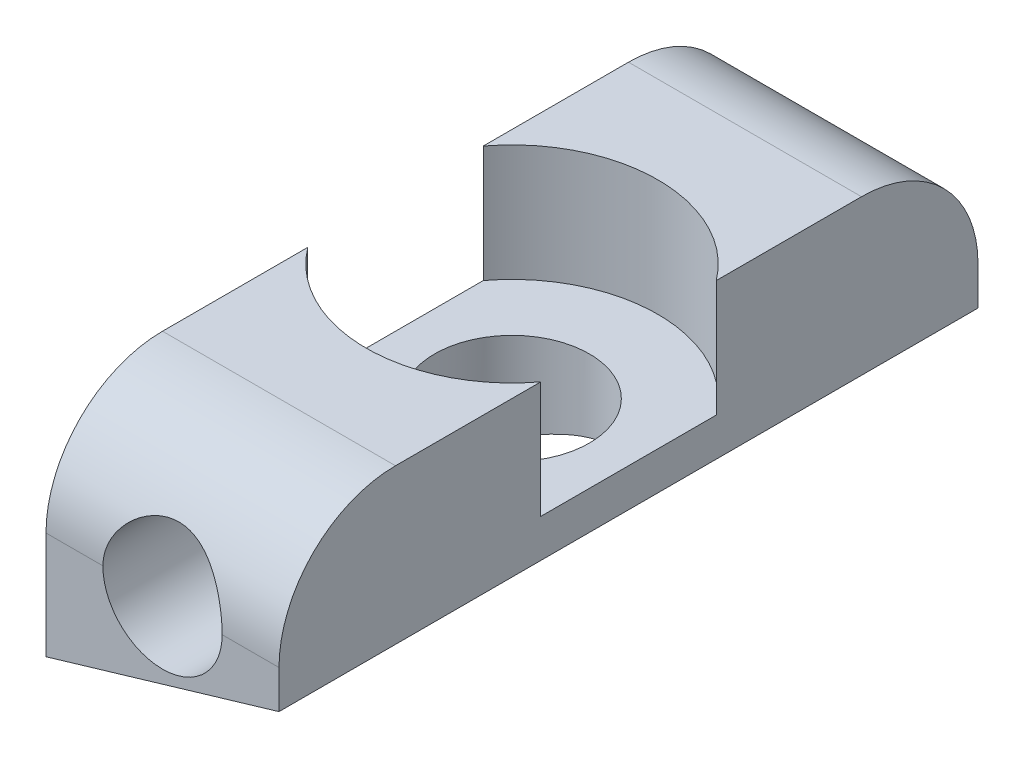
ISO-10303-21;
HEADER;
FILE_DESCRIPTION(('STEP AP214'),'2;1');
FILE_NAME('part.step','',(''),(''),'','','');
FILE_SCHEMA(('AUTOMOTIVE_DESIGN { 1 0 10303 214 1 1 1 1 }'));
ENDSEC;
DATA;
#1=APPLICATION_CONTEXT('core data for automotive mechanical design processes');
#2=APPLICATION_PROTOCOL_DEFINITION('international standard','automotive_design',2000,#1);
#3=PRODUCT_CONTEXT('',#1,'mechanical');
#4=PRODUCT('Part','Part','',(#3));
#5=PRODUCT_RELATED_PRODUCT_CATEGORY('part','',(#4));
#6=PRODUCT_DEFINITION_FORMATION('','',#4);
#7=PRODUCT_DEFINITION_CONTEXT('part definition',#1,'design');
#8=PRODUCT_DEFINITION('design','',#6,#7);
#9=PRODUCT_DEFINITION_SHAPE('','',#8);
#10=(LENGTH_UNIT() NAMED_UNIT(*) SI_UNIT(.MILLI.,.METRE.));
#11=(NAMED_UNIT(*) PLANE_ANGLE_UNIT() SI_UNIT($,.RADIAN.));
#12=(NAMED_UNIT(*) SI_UNIT($,.STERADIAN.) SOLID_ANGLE_UNIT());
#13=UNCERTAINTY_MEASURE_WITH_UNIT(LENGTH_MEASURE(1.E-05),#10,'distance_accuracy_value','');
#14=(GEOMETRIC_REPRESENTATION_CONTEXT(3) GLOBAL_UNCERTAINTY_ASSIGNED_CONTEXT((#13)) GLOBAL_UNIT_ASSIGNED_CONTEXT((#10,
#11,#12)) REPRESENTATION_CONTEXT('',''));
#15=CARTESIAN_POINT('',(0.,0.,0.));
#16=DIRECTION('',(0.,0.,1.));
#17=DIRECTION('',(1.,0.,0.));
#18=AXIS2_PLACEMENT_3D('',#15,#16,#17);
#19=CARTESIAN_POINT('',(-40.64,98.9032922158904,19.05));
#20=DIRECTION('',(0.,-1.,0.));
#21=DIRECTION('',(0.,0.,-1.));
#22=AXIS2_PLACEMENT_3D('',#19,#20,#21);
#23=PLANE('',#22);
#24=DIRECTION('',(0.,0.,-1.));
#25=VECTOR('',#24,1.);
#26=CARTESIAN_POINT('',(-34.29,98.9032922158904,19.05));
#27=LINE('',#26,#25);
#28=CARTESIAN_POINT('',(-34.29,98.9032922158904,15.875));
#29=VERTEX_POINT('',#28);
#30=CARTESIAN_POINT('',(-34.29,98.9032922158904,11.9168183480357));
#31=VERTEX_POINT('',#30);
#32=EDGE_CURVE('E186',#29,#31,#27,.T.);
#33=ORIENTED_EDGE('',*,*,#32,.T.);
#34=CARTESIAN_POINT('',(-37.465,98.9032922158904,9.525));
#35=DIRECTION('',(0.,1.,0.));
#36=DIRECTION('',(0.,0.,1.));
#37=AXIS2_PLACEMENT_3D('',#34,#35,#36);
#38=CIRCLE('',#37,3.97510000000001);
#39=CARTESIAN_POINT('',(-40.64,98.9032922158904,11.9168183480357));
#40=VERTEX_POINT('',#39);
#41=EDGE_CURVE('E140',#40,#31,#38,.T.);
#42=ORIENTED_EDGE('',*,*,#41,.F.);
#43=DIRECTION('',(0.,0.,-1.));
#44=VECTOR('',#43,1.);
#45=CARTESIAN_POINT('',(-40.64,98.9032922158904,19.05));
#46=LINE('',#45,#44);
#47=CARTESIAN_POINT('',(-40.64,98.9032922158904,15.875));
#48=VERTEX_POINT('',#47);
#49=EDGE_CURVE('E189',#48,#40,#46,.T.);
#50=ORIENTED_EDGE('',*,*,#49,.F.);
#51=DIRECTION('',(-1.,0.,0.));
#52=VECTOR('',#51,1.);
#53=CARTESIAN_POINT('',(-40.64,98.9032922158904,15.875));
#54=LINE('',#53,#52);
#55=EDGE_CURVE('E157',#48,#29,#54,.F.);
#56=ORIENTED_EDGE('',*,*,#55,.T.);
#57=EDGE_LOOP('',(#33,#42,#50,#56));
#58=FACE_BOUND('',#57,.T.);
#59=ADVANCED_FACE('F32',(#58),#23,.F.);
#60=CARTESIAN_POINT('',(-37.465,92.8072922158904,9.525));
#61=DIRECTION('',(0.,1.,0.));
#62=DIRECTION('',(0.,0.,1.));
#63=AXIS2_PLACEMENT_3D('',#60,#61,#62);
#64=CYLINDRICAL_SURFACE('',#63,2.1082);
#65=CARTESIAN_POINT('',(-37.465,93.7470922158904,9.525));
#66=DIRECTION('',(-0.283827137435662,0.958875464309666,0.));
#67=DIRECTION('',(0.958875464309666,0.283827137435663,0.));
#68=AXIS2_PLACEMENT_3D('',#65,#66,#67);
#69=ELLIPSE('',#68,2.19861710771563,2.1082);
#70=CARTESIAN_POINT('',(-35.3568,94.3711194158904,9.525));
#71=VERTEX_POINT('',#70);
#72=EDGE_CURVE('E210',#71,#71,#69,.T.);
#73=ORIENTED_EDGE('',*,*,#72,.F.);
#74=EDGE_LOOP('',(#73));
#75=FACE_BOUND('',#74,.T.);
#76=CARTESIAN_POINT('',(-37.465,95.7282922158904,9.525));
#77=DIRECTION('',(0.,1.,0.));
#78=DIRECTION('',(0.,0.,1.));
#79=AXIS2_PLACEMENT_3D('',#76,#77,#78);
#80=CIRCLE('',#79,2.1082);
#81=CARTESIAN_POINT('',(-39.0906,95.7282922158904,10.8673605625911));
#82=VERTEX_POINT('',#81);
#83=CARTESIAN_POINT('',(-35.8394,95.7282922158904,10.8673605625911));
#84=VERTEX_POINT('',#83);
#85=EDGE_CURVE('E137',#82,#84,#80,.F.);
#86=ORIENTED_EDGE('',*,*,#85,.F.);
#87=CARTESIAN_POINT('',(-35.8394,95.7282922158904,10.8673605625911));
#88=CARTESIAN_POINT('',(-35.8394040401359,95.6533922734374,10.8673692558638));
#89=CARTESIAN_POINT('',(-35.8446406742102,95.5784732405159,10.8737822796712));
#90=CARTESIAN_POINT('',(-35.864950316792,95.4317172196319,10.8977971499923));
#91=CARTESIAN_POINT('',(-35.8800608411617,95.3598931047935,10.9154416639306));
#92=CARTESIAN_POINT('',(-35.9230186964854,95.2062331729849,10.963061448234));
#93=CARTESIAN_POINT('',(-35.9529068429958,95.1255678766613,10.9948728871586));
#94=CARTESIAN_POINT('',(-36.0235833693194,94.9719428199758,11.0642480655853));
#95=CARTESIAN_POINT('',(-36.0643852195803,94.8989927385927,11.1018188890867));
#96=CARTESIAN_POINT('',(-36.1572432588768,94.7589729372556,11.1797063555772));
#97=CARTESIAN_POINT('',(-36.2095641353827,94.6921050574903,11.2200689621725));
#98=CARTESIAN_POINT('',(-36.3244114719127,94.5668969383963,11.2993828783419));
#99=CARTESIAN_POINT('',(-36.3869303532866,94.5085504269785,11.3383352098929));
#100=CARTESIAN_POINT('',(-36.5189756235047,94.4037542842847,11.4104596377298));
#101=CARTESIAN_POINT('',(-36.5880783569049,94.3568972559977,11.4438095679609));
#102=CARTESIAN_POINT('',(-36.7347588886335,94.2735008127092,11.5042741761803));
#103=CARTESIAN_POINT('',(-36.8123285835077,94.2369516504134,11.5313947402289));
#104=CARTESIAN_POINT('',(-36.9622394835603,94.1806445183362,11.5736227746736));
#105=CARTESIAN_POINT('',(-37.0336000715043,94.1591839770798,11.5899261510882));
#106=CARTESIAN_POINT('',(-37.1798367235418,94.1261485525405,11.6151389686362));
#107=CARTESIAN_POINT('',(-37.2547104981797,94.1145673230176,11.6240531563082));
#108=CARTESIAN_POINT('',(-37.4060966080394,94.10198058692,11.6337448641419));
#109=CARTESIAN_POINT('',(-37.4826130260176,94.1010055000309,11.6344989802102));
#110=CARTESIAN_POINT('',(-37.634659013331,94.1097769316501,11.6277401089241));
#111=CARTESIAN_POINT('',(-37.7101884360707,94.1195250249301,11.6202259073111));
#112=CARTESIAN_POINT('',(-37.8548253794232,94.1484752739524,11.5980826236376));
#113=CARTESIAN_POINT('',(-37.9240693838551,94.1672523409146,11.5837737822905));
#114=CARTESIAN_POINT('',(-38.0581537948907,94.2131123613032,11.5492220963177));
#115=CARTESIAN_POINT('',(-38.1229931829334,94.2401972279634,11.5289778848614));
#116=CARTESIAN_POINT('',(-38.2538511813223,94.3048590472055,11.4814158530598));
#117=CARTESIAN_POINT('',(-38.3192813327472,94.3432380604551,11.4535790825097));
#118=CARTESIAN_POINT('',(-38.4429907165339,94.4276284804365,11.3938948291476));
#119=CARTESIAN_POINT('',(-38.5012646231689,94.4736455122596,11.3620443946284));
#120=CARTESIAN_POINT('',(-38.621392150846,94.5823595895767,11.2894065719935));
#121=CARTESIAN_POINT('',(-38.6815897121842,94.6465481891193,11.2481138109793));
#122=CARTESIAN_POINT('',(-38.7909586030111,94.7837713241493,11.1654374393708));
#123=CARTESIAN_POINT('',(-38.8401212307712,94.8568127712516,11.1240537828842));
#124=CARTESIAN_POINT('',(-38.9194852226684,94.9985692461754,11.0518783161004));
#125=CARTESIAN_POINT('',(-38.9514829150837,95.0659626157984,11.0204729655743));
#126=CARTESIAN_POINT('',(-39.0064891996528,95.2066934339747,10.9637073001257));
#127=CARTESIAN_POINT('',(-39.0295179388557,95.2800171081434,10.9383334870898));
#128=CARTESIAN_POINT('',(-39.0610337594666,95.4139690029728,10.9025405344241));
#129=CARTESIAN_POINT('',(-39.0716700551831,95.4735095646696,10.8900053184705));
#130=CARTESIAN_POINT('',(-39.086223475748,95.5944814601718,10.8726930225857));
#131=CARTESIAN_POINT('',(-39.0901517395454,95.6559094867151,10.8679030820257));
#132=CARTESIAN_POINT('',(-39.0909762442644,95.7790349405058,10.8669052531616));
#133=CARTESIAN_POINT('',(-39.087855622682,95.8407326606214,10.8707179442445));
#134=CARTESIAN_POINT('',(-39.0748212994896,95.962408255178,10.8862783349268));
#135=CARTESIAN_POINT('',(-39.0648972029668,96.0223833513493,10.898038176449));
#136=CARTESIAN_POINT('',(-39.0345972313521,96.1587732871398,10.9326760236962));
#137=CARTESIAN_POINT('',(-39.0118451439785,96.2340348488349,10.9579491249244));
#138=CARTESIAN_POINT('',(-38.956938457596,96.3784456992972,11.0150327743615));
#139=CARTESIAN_POINT('',(-38.9247559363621,96.4475760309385,11.0468626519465));
#140=CARTESIAN_POINT('',(-38.8396436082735,96.6018448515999,11.1247521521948));
#141=CARTESIAN_POINT('',(-38.7833763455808,96.6845454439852,11.1719966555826));
#142=CARTESIAN_POINT('',(-38.6566195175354,96.8384905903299,11.2659156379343));
#143=CARTESIAN_POINT('',(-38.5861378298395,96.9097414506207,11.3125904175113));
#144=CARTESIAN_POINT('',(-38.4445797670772,97.0282915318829,11.3932599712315));
#145=CARTESIAN_POINT('',(-38.375654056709,97.0776032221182,11.4280597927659));
#146=CARTESIAN_POINT('',(-38.2288961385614,97.1657684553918,11.4915539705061));
#147=CARTESIAN_POINT('',(-38.1510780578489,97.204638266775,11.5202578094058));
#148=CARTESIAN_POINT('',(-38.0009376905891,97.2647814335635,11.5651963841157));
#149=CARTESIAN_POINT('',(-37.9297256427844,97.2878744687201,11.5826909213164));
#150=CARTESIAN_POINT('',(-37.7834399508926,97.3241739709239,11.6103370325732));
#151=CARTESIAN_POINT('',(-37.7083684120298,97.3373857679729,11.6204925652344));
#152=CARTESIAN_POINT('',(-37.5561874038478,97.3531395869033,11.6326135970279));
#153=CARTESIAN_POINT('',(-37.4790719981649,97.3556460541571,11.6345518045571));
#154=CARTESIAN_POINT('',(-37.3255172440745,97.3497186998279,11.6299827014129));
#155=CARTESIAN_POINT('',(-37.2490779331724,97.3412842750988,11.623474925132));
#156=CARTESIAN_POINT('',(-37.1031655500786,97.3147554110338,11.6031554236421));
#157=CARTESIAN_POINT('',(-37.0335373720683,97.2971907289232,11.5897446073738));
#158=CARTESIAN_POINT('',(-36.898505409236,97.2536436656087,11.5568528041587));
#159=CARTESIAN_POINT('',(-36.8331026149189,97.2276593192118,11.5373704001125));
#160=CARTESIAN_POINT('',(-36.7015405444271,97.1654749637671,11.4914546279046));
#161=CARTESIAN_POINT('',(-36.6359024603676,97.1285377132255,11.4645359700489));
#162=CARTESIAN_POINT('',(-36.5115784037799,97.0470404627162,11.4065443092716));
#163=CARTESIAN_POINT('',(-36.4528970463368,97.0024754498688,11.3754685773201));
#164=CARTESIAN_POINT('',(-36.3318566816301,96.8971465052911,11.3044221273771));
#165=CARTESIAN_POINT('',(-36.2710856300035,96.834923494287,11.2639112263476));
#166=CARTESIAN_POINT('',(-36.1602415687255,96.7017897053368,11.1823607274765));
#167=CARTESIAN_POINT('',(-36.1101781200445,96.6308712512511,11.1413206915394));
#168=CARTESIAN_POINT('',(-36.0269885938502,96.4901971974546,11.0675032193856));
#169=CARTESIAN_POINT('',(-35.9925176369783,96.4214430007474,11.0343390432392));
#170=CARTESIAN_POINT('',(-35.9330195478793,96.2775200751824,10.9739091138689));
#171=CARTESIAN_POINT('',(-35.9079762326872,96.20236261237,10.9466332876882));
#172=CARTESIAN_POINT('',(-35.8724879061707,96.0610446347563,10.9066645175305));
#173=CARTESIAN_POINT('',(-35.8601753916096,95.9958797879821,10.8921872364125));
#174=CARTESIAN_POINT('',(-35.8436402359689,95.8632415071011,10.8725435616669));
#175=CARTESIAN_POINT('',(-35.8393963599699,95.7957746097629,10.8673527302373));
#176=CARTESIAN_POINT('',(-35.8394,95.7282922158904,10.8673605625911));
#177=B_SPLINE_CURVE_WITH_KNOTS('',3,(#87,#88,#89,#90,#91,#92,#93,#94,#95,#96,#97,#98,#99,#100,
#101,#102,#103,#104,#105,#106,#107,#108,#109,#110,#111,#112,#113,#114,#115,#116,#117,#118,#119,
#120,#121,#122,#123,#124,#125,#126,#127,#128,#129,#130,#131,#132,#133,#134,#135,#136,#137,#138,
#139,#140,#141,#142,#143,#144,#145,#146,#147,#148,#149,#150,#151,#152,#153,#154,#155,#156,#157,
#158,#159,#160,#161,#162,#163,#164,#165,#166,#167,#168,#169,#170,#171,#172,#173,#174,#175,#176),
.UNSPECIFIED.,.T.,.F.,(4,2,2,2,2,2,2,2,2,2,2,2,2,2,2,2,2,2,2,2,2,2,2,2,2,2,2,2,2,2,2,2,2,2,2,2,
2,2,2,2,2,2,2,2,4),(0.,0.224342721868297,0.44954282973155,0.723192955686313,0.997182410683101,
1.27828529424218,1.55918021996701,1.82784431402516,2.09625349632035,2.32411147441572,
2.55182297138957,2.78018740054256,3.00858537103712,3.22715024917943,3.44576549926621,
3.68729000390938,3.9289931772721,4.21953677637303,4.51030868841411,4.7524187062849,
4.99398168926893,5.17853635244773,5.36278425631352,5.54747338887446,5.73244533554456,
5.97883253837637,6.22595676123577,6.55621283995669,6.88628639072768,7.16007770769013,
7.43343995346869,7.66310056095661,7.89263719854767,8.12293558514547,8.35324666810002,
8.57148041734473,8.78976514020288,9.02883917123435,9.2680709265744,9.55486074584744,
9.84190558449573,10.0924065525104,10.3424755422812,10.5451350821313,10.7472605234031),.UNSPECIFIED.);
#178=EDGE_CURVE('E125',#84,#82,#177,.T.);
#179=ORIENTED_EDGE('',*,*,#178,.F.);
#180=EDGE_LOOP('',(#86,#179));
#181=FACE_BOUND('',#180,.T.);
#182=ADVANCED_FACE('F142',(#75,#181),#64,.F.);
#183=CARTESIAN_POINT('',(-34.29,94.6868922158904,19.05));
#184=DIRECTION('',(-0.283827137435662,0.958875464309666,0.));
#185=DIRECTION('',(-0.958875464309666,-0.283827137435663,0.));
#186=AXIS2_PLACEMENT_3D('',#183,#184,#185);
#187=PLANE('',#186);
#188=ORIENTED_EDGE('',*,*,#72,.T.);
#189=EDGE_LOOP('',(#188));
#190=FACE_BOUND('',#189,.T.);
#191=DIRECTION('',(0.958875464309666,0.283827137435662,0.));
#192=VECTOR('',#191,1.);
#193=CARTESIAN_POINT('',(-34.29,94.6868922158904,0.));
#194=LINE('',#193,#192);
#195=CARTESIAN_POINT('',(-40.64,92.8072922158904,0.));
#196=VERTEX_POINT('',#195);
#197=CARTESIAN_POINT('',(-34.29,94.6868922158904,0.));
#198=VERTEX_POINT('',#197);
#199=EDGE_CURVE('E207',#196,#198,#194,.T.);
#200=ORIENTED_EDGE('',*,*,#199,.T.);
#201=DIRECTION('',(0.,0.,-1.));
#202=VECTOR('',#201,1.);
#203=CARTESIAN_POINT('',(-34.29,94.6868922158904,19.05));
#204=LINE('',#203,#202);
#205=CARTESIAN_POINT('',(-34.29,94.6868922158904,19.05));
#206=VERTEX_POINT('',#205);
#207=EDGE_CURVE('E183',#206,#198,#204,.T.);
#208=ORIENTED_EDGE('',*,*,#207,.F.);
#209=DIRECTION('',(0.958875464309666,0.283827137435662,0.));
#210=VECTOR('',#209,1.);
#211=CARTESIAN_POINT('',(-34.29,94.6868922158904,19.05));
#212=LINE('',#211,#210);
#213=CARTESIAN_POINT('',(-40.64,92.8072922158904,19.05));
#214=VERTEX_POINT('',#213);
#215=EDGE_CURVE('E199',#214,#206,#212,.T.);
#216=ORIENTED_EDGE('',*,*,#215,.F.);
#217=DIRECTION('',(0.,0.,-1.));
#218=VECTOR('',#217,1.);
#219=CARTESIAN_POINT('',(-40.64,92.8072922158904,19.05));
#220=LINE('',#219,#218);
#221=EDGE_CURVE('E192',#214,#196,#220,.T.);
#222=ORIENTED_EDGE('',*,*,#221,.T.);
#223=EDGE_LOOP('',(#200,#208,#216,#222));
#224=FACE_BOUND('',#223,.T.);
#225=ADVANCED_FACE('F34',(#190,#224),#187,.F.);
#226=CARTESIAN_POINT('',(-34.29,98.9032922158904,19.05));
#227=DIRECTION('',(-1.,0.,0.));
#228=DIRECTION('',(0.,0.,1.));
#229=AXIS2_PLACEMENT_3D('',#226,#227,#228);
#230=PLANE('',#229);
#231=DIRECTION('',(0.,0.,-1.));
#232=VECTOR('',#231,1.);
#233=CARTESIAN_POINT('',(-34.29,95.7282922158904,19.05));
#234=LINE('',#233,#232);
#235=CARTESIAN_POINT('',(-34.29,95.7282922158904,11.9168183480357));
#236=VERTEX_POINT('',#235);
#237=CARTESIAN_POINT('',(-34.29,95.7282922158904,7.13318165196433));
#238=VERTEX_POINT('',#237);
#239=EDGE_CURVE('E146',#236,#238,#234,.T.);
#240=ORIENTED_EDGE('',*,*,#239,.F.);
#241=DIRECTION('',(0.,1.,0.));
#242=VECTOR('',#241,1.);
#243=CARTESIAN_POINT('',(-34.29,95.7282922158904,11.9168183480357));
#244=LINE('',#243,#242);
#245=EDGE_CURVE('E213',#236,#31,#244,.T.);
#246=ORIENTED_EDGE('',*,*,#245,.T.);
#247=ORIENTED_EDGE('',*,*,#32,.F.);
#248=CARTESIAN_POINT('',(-34.29,95.7282922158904,15.875));
#249=DIRECTION('',(-1.,0.,0.));
#250=DIRECTION('',(0.,0.,1.));
#251=AXIS2_PLACEMENT_3D('',#248,#249,#250);
#252=CIRCLE('',#251,3.175);
#253=CARTESIAN_POINT('',(-34.29,95.7282922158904,19.05));
#254=VERTEX_POINT('',#253);
#255=EDGE_CURVE('E151',#29,#254,#252,.F.);
#256=ORIENTED_EDGE('',*,*,#255,.T.);
#257=DIRECTION('',(0.,1.,0.));
#258=VECTOR('',#257,1.);
#259=CARTESIAN_POINT('',(-34.29,98.9032922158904,19.05));
#260=LINE('',#259,#258);
#261=EDGE_CURVE('E197',#206,#254,#260,.T.);
#262=ORIENTED_EDGE('',*,*,#261,.F.);
#263=ORIENTED_EDGE('',*,*,#207,.T.);
#264=DIRECTION('',(0.,1.,0.));
#265=VECTOR('',#264,1.);
#266=CARTESIAN_POINT('',(-34.29,98.9032922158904,0.));
#267=LINE('',#266,#265);
#268=CARTESIAN_POINT('',(-34.29,95.7282922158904,0.));
#269=VERTEX_POINT('',#268);
#270=EDGE_CURVE('E204',#198,#269,#267,.T.);
#271=ORIENTED_EDGE('',*,*,#270,.T.);
#272=CARTESIAN_POINT('',(-34.29,95.7282922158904,3.175));
#273=DIRECTION('',(-1.,0.,0.));
#274=DIRECTION('',(0.,0.,1.));
#275=AXIS2_PLACEMENT_3D('',#272,#273,#274);
#276=CIRCLE('',#275,3.175);
#277=CARTESIAN_POINT('',(-34.29,98.9032922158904,3.17500000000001));
#278=VERTEX_POINT('',#277);
#279=EDGE_CURVE('E173',#269,#278,#276,.F.);
#280=ORIENTED_EDGE('',*,*,#279,.T.);
#281=CARTESIAN_POINT('',(-34.29,98.9032922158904,7.13318165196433));
#282=VERTEX_POINT('',#281);
#283=EDGE_CURVE('E188',#282,#278,#27,.T.);
#284=ORIENTED_EDGE('',*,*,#283,.F.);
#285=DIRECTION('',(0.,1.,0.));
#286=VECTOR('',#285,1.);
#287=CARTESIAN_POINT('',(-34.29,95.7282922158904,7.13318165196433));
#288=LINE('',#287,#286);
#289=EDGE_CURVE('E216',#282,#238,#288,.F.);
#290=ORIENTED_EDGE('',*,*,#289,.T.);
#291=EDGE_LOOP('',(#240,#246,#247,#256,#262,#263,#271,#280,#284,#290));
#292=FACE_BOUND('',#291,.T.);
#293=ADVANCED_FACE('F278',(#292),#230,.F.);
#294=CARTESIAN_POINT('',(-40.64,98.9032922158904,7.13318165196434));
#295=VERTEX_POINT('',#294);
#296=CARTESIAN_POINT('',(-40.64,98.9032922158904,3.17500000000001));
#297=VERTEX_POINT('',#296);
#298=EDGE_CURVE('E191',#295,#297,#46,.T.);
#299=ORIENTED_EDGE('',*,*,#298,.F.);
#300=EDGE_CURVE('E220',#282,#295,#38,.T.);
#301=ORIENTED_EDGE('',*,*,#300,.F.);
#302=ORIENTED_EDGE('',*,*,#283,.T.);
#303=DIRECTION('',(-1.,0.,0.));
#304=VECTOR('',#303,1.);
#305=CARTESIAN_POINT('',(-40.64,98.9032922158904,3.175));
#306=LINE('',#305,#304);
#307=EDGE_CURVE('E180',#278,#297,#306,.T.);
#308=ORIENTED_EDGE('',*,*,#307,.T.);
#309=EDGE_LOOP('',(#299,#301,#302,#308));
#310=FACE_BOUND('',#309,.T.);
#311=ADVANCED_FACE('F256',(#310),#23,.F.);
#312=CARTESIAN_POINT('',(-40.64,92.8072922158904,19.05));
#313=DIRECTION('',(1.,0.,0.));
#314=DIRECTION('',(0.,0.,-1.));
#315=AXIS2_PLACEMENT_3D('',#312,#313,#314);
#316=PLANE('',#315);
#317=DIRECTION('',(0.,0.,1.));
#318=VECTOR('',#317,1.);
#319=CARTESIAN_POINT('',(-40.64,95.7282922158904,19.05));
#320=LINE('',#319,#318);
#321=CARTESIAN_POINT('',(-40.64,95.7282922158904,7.13318165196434));
#322=VERTEX_POINT('',#321);
#323=CARTESIAN_POINT('',(-40.64,95.7282922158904,11.9168183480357));
#324=VERTEX_POINT('',#323);
#325=EDGE_CURVE('E143',#322,#324,#320,.T.);
#326=ORIENTED_EDGE('',*,*,#325,.F.);
#327=DIRECTION('',(0.,1.,0.));
#328=VECTOR('',#327,1.);
#329=CARTESIAN_POINT('',(-40.64,95.7282922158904,7.13318165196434));
#330=LINE('',#329,#328);
#331=EDGE_CURVE('E11',#322,#295,#330,.T.);
#332=ORIENTED_EDGE('',*,*,#331,.T.);
#333=ORIENTED_EDGE('',*,*,#298,.T.);
#334=CARTESIAN_POINT('',(-40.64,95.7282922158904,3.175));
#335=DIRECTION('',(1.,0.,0.));
#336=DIRECTION('',(0.,0.,-1.));
#337=AXIS2_PLACEMENT_3D('',#334,#335,#336);
#338=CIRCLE('',#337,3.175);
#339=CARTESIAN_POINT('',(-40.64,95.7282922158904,0.));
#340=VERTEX_POINT('',#339);
#341=EDGE_CURVE('E178',#297,#340,#338,.F.);
#342=ORIENTED_EDGE('',*,*,#341,.T.);
#343=DIRECTION('',(0.,-1.,0.));
#344=VECTOR('',#343,1.);
#345=CARTESIAN_POINT('',(-40.64,92.8072922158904,0.));
#346=LINE('',#345,#344);
#347=EDGE_CURVE('E202',#340,#196,#346,.T.);
#348=ORIENTED_EDGE('',*,*,#347,.T.);
#349=ORIENTED_EDGE('',*,*,#221,.F.);
#350=DIRECTION('',(0.,-1.,0.));
#351=VECTOR('',#350,1.);
#352=CARTESIAN_POINT('',(-40.64,92.8072922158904,19.05));
#353=LINE('',#352,#351);
#354=CARTESIAN_POINT('',(-40.64,95.7282922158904,19.05));
#355=VERTEX_POINT('',#354);
#356=EDGE_CURVE('E195',#355,#214,#353,.T.);
#357=ORIENTED_EDGE('',*,*,#356,.F.);
#358=CARTESIAN_POINT('',(-40.64,95.7282922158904,15.875));
#359=DIRECTION('',(1.,0.,0.));
#360=DIRECTION('',(0.,0.,-1.));
#361=AXIS2_PLACEMENT_3D('',#358,#359,#360);
#362=CIRCLE('',#361,3.175);
#363=EDGE_CURVE('E162',#355,#48,#362,.F.);
#364=ORIENTED_EDGE('',*,*,#363,.T.);
#365=ORIENTED_EDGE('',*,*,#49,.T.);
#366=DIRECTION('',(0.,1.,0.));
#367=VECTOR('',#366,1.);
#368=CARTESIAN_POINT('',(-40.64,95.7282922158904,11.9168183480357));
#369=LINE('',#368,#367);
#370=EDGE_CURVE('E40',#40,#324,#369,.F.);
#371=ORIENTED_EDGE('',*,*,#370,.T.);
#372=EDGE_LOOP('',(#326,#332,#333,#342,#348,#349,#357,#364,#365,#371));
#373=FACE_BOUND('',#372,.T.);
#374=ADVANCED_FACE('F254',(#373),#316,.F.);
#375=CARTESIAN_POINT('',(-40.64,92.8072922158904,19.05));
#376=DIRECTION('',(0.,0.,-1.));
#377=DIRECTION('',(-1.,0.,0.));
#378=AXIS2_PLACEMENT_3D('',#375,#376,#377);
#379=PLANE('',#378);
#380=DIRECTION('',(-1.,0.,0.));
#381=VECTOR('',#380,1.);
#382=CARTESIAN_POINT('',(-40.64,95.7282922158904,19.05));
#383=LINE('',#382,#381);
#384=CARTESIAN_POINT('',(-35.8394,95.7282922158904,19.05));
#385=VERTEX_POINT('',#384);
#386=EDGE_CURVE('E167',#254,#385,#383,.T.);
#387=ORIENTED_EDGE('',*,*,#386,.T.);
#388=CARTESIAN_POINT('',(-37.465,95.7282922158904,19.05));
#389=DIRECTION('',(0.,0.,1.));
#390=DIRECTION('',(1.,0.,0.));
#391=AXIS2_PLACEMENT_3D('',#388,#389,#390);
#392=CIRCLE('',#391,1.6256);
#393=CARTESIAN_POINT('',(-39.0906,95.7282922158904,19.05));
#394=VERTEX_POINT('',#393);
#395=EDGE_CURVE('E46',#394,#385,#392,.T.);
#396=ORIENTED_EDGE('',*,*,#395,.F.);
#397=EDGE_CURVE('E172',#394,#355,#383,.T.);
#398=ORIENTED_EDGE('',*,*,#397,.T.);
#399=ORIENTED_EDGE('',*,*,#356,.T.);
#400=ORIENTED_EDGE('',*,*,#215,.T.);
#401=ORIENTED_EDGE('',*,*,#261,.T.);
#402=EDGE_LOOP('',(#387,#396,#398,#399,#400,#401));
#403=FACE_BOUND('',#402,.T.);
#404=ADVANCED_FACE('F273',(#403),#379,.F.);
#405=CARTESIAN_POINT('',(-40.64,92.8072922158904,0.));
#406=DIRECTION('',(0.,0.,-1.));
#407=DIRECTION('',(-1.,0.,0.));
#408=AXIS2_PLACEMENT_3D('',#405,#406,#407);
#409=PLANE('',#408);
#410=ORIENTED_EDGE('',*,*,#347,.F.);
#411=DIRECTION('',(-1.,0.,0.));
#412=VECTOR('',#411,1.);
#413=CARTESIAN_POINT('',(-40.64,95.7282922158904,0.));
#414=LINE('',#413,#412);
#415=EDGE_CURVE('E176',#340,#269,#414,.F.);
#416=ORIENTED_EDGE('',*,*,#415,.T.);
#417=ORIENTED_EDGE('',*,*,#270,.F.);
#418=ORIENTED_EDGE('',*,*,#199,.F.);
#419=EDGE_LOOP('',(#410,#416,#417,#418));
#420=FACE_BOUND('',#419,.T.);
#421=ADVANCED_FACE('F266',(#420),#409,.T.);
#422=CARTESIAN_POINT('',(-40.64,95.7282922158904,3.175));
#423=DIRECTION('',(1.,0.,0.));
#424=DIRECTION('',(0.,0.,-1.));
#425=AXIS2_PLACEMENT_3D('',#422,#423,#424);
#426=CYLINDRICAL_SURFACE('',#425,3.175);
#427=ORIENTED_EDGE('',*,*,#279,.F.);
#428=ORIENTED_EDGE('',*,*,#415,.F.);
#429=ORIENTED_EDGE('',*,*,#341,.F.);
#430=ORIENTED_EDGE('',*,*,#307,.F.);
#431=EDGE_LOOP('',(#427,#428,#429,#430));
#432=FACE_BOUND('',#431,.T.);
#433=ADVANCED_FACE('F260',(#432),#426,.T.);
#434=CARTESIAN_POINT('',(-40.64,95.7282922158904,15.875));
#435=DIRECTION('',(-1.,0.,0.));
#436=DIRECTION('',(0.,0.,1.));
#437=AXIS2_PLACEMENT_3D('',#434,#435,#436);
#438=CYLINDRICAL_SURFACE('',#437,3.175);
#439=CARTESIAN_POINT('',(-35.8394,95.7282922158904,19.05));
#440=CARTESIAN_POINT('',(-35.8394054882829,95.6430791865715,19.0499951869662));
#441=CARTESIAN_POINT('',(-35.8461394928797,95.5577720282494,19.0465330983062));
#442=CARTESIAN_POINT('',(-35.8727702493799,95.3896946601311,19.0330244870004));
#443=CARTESIAN_POINT('',(-35.8926903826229,95.3069292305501,19.0229662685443));
#444=CARTESIAN_POINT('',(-35.9447019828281,95.1466200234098,18.9973144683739));
#445=CARTESIAN_POINT('',(-35.9767454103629,95.0690570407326,18.9817427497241));
#446=CARTESIAN_POINT('',(-36.0518367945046,94.9205317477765,18.9464789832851));
#447=CARTESIAN_POINT('',(-36.0948842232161,94.8495691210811,18.9267871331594));
#448=CARTESIAN_POINT('',(-36.1938151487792,94.7112676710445,18.8836303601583));
#449=CARTESIAN_POINT('',(-36.2503330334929,94.6444330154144,18.860006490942));
#450=CARTESIAN_POINT('',(-36.3732287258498,94.5207230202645,18.8121431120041));
#451=CARTESIAN_POINT('',(-36.4396143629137,94.4638556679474,18.7879031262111));
#452=CARTESIAN_POINT('',(-36.5869035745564,94.3569919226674,18.739242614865));
#453=CARTESIAN_POINT('',(-36.6685523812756,94.3079464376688,18.7149714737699));
#454=CARTESIAN_POINT('',(-36.8403020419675,94.2244891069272,18.6716811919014));
#455=CARTESIAN_POINT('',(-36.9303965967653,94.1900664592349,18.6526581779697));
#456=CARTESIAN_POINT('',(-37.1109037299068,94.1391308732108,18.6238191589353));
#457=CARTESIAN_POINT('',(-37.2009616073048,94.1216534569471,18.6135122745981));
#458=CARTESIAN_POINT('',(-37.3832712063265,94.102169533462,18.6019935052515));
#459=CARTESIAN_POINT('',(-37.4755204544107,94.1001463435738,18.6007718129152));
#460=CARTESIAN_POINT('',(-37.6469900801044,94.1109224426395,18.6071705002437));
#461=CARTESIAN_POINT('',(-37.7263781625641,94.1218731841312,18.613688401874));
#462=CARTESIAN_POINT('',(-37.8819795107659,94.1550678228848,18.6328894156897));
#463=CARTESIAN_POINT('',(-37.9581916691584,94.1773156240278,18.6455746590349));
#464=CARTESIAN_POINT('',(-38.1074549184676,94.2328591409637,18.6759501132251));
#465=CARTESIAN_POINT('',(-38.180392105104,94.2663985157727,18.6937493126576));
#466=CARTESIAN_POINT('',(-38.3199610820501,94.34338203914,18.7323591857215));
#467=CARTESIAN_POINT('',(-38.3865900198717,94.3868306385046,18.7531712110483));
#468=CARTESIAN_POINT('',(-38.5210376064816,94.4891720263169,18.79882375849));
#469=CARTESIAN_POINT('',(-38.5878223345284,94.5493534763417,18.8238306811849));
#470=CARTESIAN_POINT('',(-38.7107943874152,94.6801350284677,18.8728107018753));
#471=CARTESIAN_POINT('',(-38.7669761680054,94.7507405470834,18.8967832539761));
#472=CARTESIAN_POINT('',(-38.8698509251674,94.9048972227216,18.9424782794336));
#473=CARTESIAN_POINT('',(-38.915915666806,94.9889242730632,18.9640242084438));
#474=CARTESIAN_POINT('',(-38.9928688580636,95.1649152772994,19.0009058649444));
#475=CARTESIAN_POINT('',(-39.0237699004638,95.256872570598,19.0162467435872));
#476=CARTESIAN_POINT('',(-39.0668786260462,95.4376942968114,19.0378705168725));
#477=CARTESIAN_POINT('',(-39.0804578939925,95.5261516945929,19.0448153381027));
#478=CARTESIAN_POINT('',(-39.092871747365,95.7043480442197,19.0511586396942));
#479=CARTESIAN_POINT('',(-39.0917138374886,95.7940863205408,19.0505609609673));
#480=CARTESIAN_POINT('',(-39.0754421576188,95.9644490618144,19.0422598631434));
#481=CARTESIAN_POINT('',(-39.0614823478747,96.0452167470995,19.0351440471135));
#482=CARTESIAN_POINT('',(-39.0218458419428,96.2030890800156,19.0153065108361));
#483=CARTESIAN_POINT('',(-38.9961678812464,96.2801933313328,19.0025841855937));
#484=CARTESIAN_POINT('',(-38.9332015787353,96.4310182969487,18.9722383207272));
#485=CARTESIAN_POINT('',(-38.8956136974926,96.5045878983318,18.9544897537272));
#486=CARTESIAN_POINT('',(-38.810240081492,96.6446090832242,18.9157686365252));
#487=CARTESIAN_POINT('',(-38.7624501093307,96.7110576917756,18.8947947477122));
#488=CARTESIAN_POINT('',(-38.6524307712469,96.8421280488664,18.8491027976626));
#489=CARTESIAN_POINT('',(-38.5892270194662,96.9058761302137,18.8242209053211));
#490=CARTESIAN_POINT('',(-38.4530357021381,97.0222761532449,18.775039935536));
#491=CARTESIAN_POINT('',(-38.3800406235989,97.074919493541,18.7507413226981));
#492=CARTESIAN_POINT('',(-38.2213215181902,97.1703696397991,18.7041368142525));
#493=CARTESIAN_POINT('',(-38.1351185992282,97.2124774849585,18.6820136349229));
#494=CARTESIAN_POINT('',(-37.9553660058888,97.2811411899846,18.6446271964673));
#495=CARTESIAN_POINT('',(-37.8618264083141,97.3077179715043,18.6293547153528));
#496=CARTESIAN_POINT('',(-37.6797559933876,97.3420401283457,18.609374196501));
#497=CARTESIAN_POINT('',(-37.5916224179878,97.3513651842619,18.6037833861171));
#498=CARTESIAN_POINT('',(-37.414910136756,97.355518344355,18.6013110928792));
#499=CARTESIAN_POINT('',(-37.3263316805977,97.3503538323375,18.6044251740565));
#500=CARTESIAN_POINT('',(-37.1610142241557,97.3271682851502,18.6180575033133));
#501=CARTESIAN_POINT('',(-37.0840038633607,97.3105441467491,18.627769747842));
#502=CARTESIAN_POINT('',(-36.9339694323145,97.266698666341,18.6525097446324));
#503=CARTESIAN_POINT('',(-36.8609467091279,97.2394737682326,18.667539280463));
#504=CARTESIAN_POINT('',(-36.7155527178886,97.1731831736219,18.7024376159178));
#505=CARTESIAN_POINT('',(-36.6435495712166,97.133448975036,18.722562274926));
#506=CARTESIAN_POINT('',(-36.5067558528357,97.0439788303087,18.764990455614));
#507=CARTESIAN_POINT('',(-36.4419691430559,96.9942375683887,18.7872951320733));
#508=CARTESIAN_POINT('',(-36.3127033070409,96.8786171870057,18.8350293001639));
#509=CARTESIAN_POINT('',(-36.249352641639,96.8114819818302,18.8604890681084));
#510=CARTESIAN_POINT('',(-36.1345307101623,96.6668817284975,18.9090548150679));
#511=CARTESIAN_POINT('',(-36.0830662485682,96.5894108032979,18.9321594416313));
#512=CARTESIAN_POINT('',(-35.9931236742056,96.4247585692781,18.9738482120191));
#513=CARTESIAN_POINT('',(-35.9548183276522,96.3374666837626,18.9923713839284));
#514=CARTESIAN_POINT('',(-35.8939411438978,96.1565465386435,19.0223107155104));
#515=CARTESIAN_POINT('',(-35.8713254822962,96.0629367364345,19.0337466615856));
#516=CARTESIAN_POINT('',(-35.8512516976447,95.9283023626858,19.0439454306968));
#517=CARTESIAN_POINT('',(-35.8468142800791,95.8884715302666,19.0462093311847));
#518=CARTESIAN_POINT('',(-35.8408871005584,95.8085315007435,19.0492377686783));
#519=CARTESIAN_POINT('',(-35.8393974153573,95.7684222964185,19.050002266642));
#520=CARTESIAN_POINT('',(-35.8394,95.7282922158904,19.05));
#521=B_SPLINE_CURVE_WITH_KNOTS('',3,(#439,#440,#441,#442,#443,#444,#445,#446,#447,#448,#449,
#450,#451,#452,#453,#454,#455,#456,#457,#458,#459,#460,#461,#462,#463,#464,#465,#466,#467,#468,
#469,#470,#471,#472,#473,#474,#475,#476,#477,#478,#479,#480,#481,#482,#483,#484,#485,#486,#487,
#488,#489,#490,#491,#492,#493,#494,#495,#496,#497,#498,#499,#500,#501,#502,#503,#504,#505,#506,
#507,#508,#509,#510,#511,#512,#513,#514,#515,#516,#517,#518,#519,#520),.UNSPECIFIED.,.T.,.F.,(4,
2,2,2,2,2,2,2,2,2,2,2,2,2,2,2,2,2,2,2,2,2,2,2,2,2,2,2,2,2,2,2,2,2,2,2,2,2,2,2,4),(0.,
0.255476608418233,0.511407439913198,0.766334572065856,1.0212494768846,1.2921064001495,
1.5631793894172,1.85656584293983,2.1497351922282,2.42501966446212,2.70000692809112,
2.94009531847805,3.18026673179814,3.42599386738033,3.67183159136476,3.9505665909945,
4.22944693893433,4.52251676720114,4.81534280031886,5.08314974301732,5.35082031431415,
5.59650795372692,5.84222211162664,6.09468552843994,6.34725400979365,6.62551866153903,
6.90399806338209,7.19777075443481,7.49114679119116,7.75599892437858,8.02071611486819,
8.25782749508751,8.49501848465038,8.74802553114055,9.00116733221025,9.28712267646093,
9.57324131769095,9.86298443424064,10.1519149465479,10.2722255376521,10.3925392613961),.UNSPECIFIED.);
#522=EDGE_CURVE('E237',#394,#385,#521,.T.);
#523=ORIENTED_EDGE('',*,*,#522,.T.);
#524=ORIENTED_EDGE('',*,*,#386,.F.);
#525=ORIENTED_EDGE('',*,*,#255,.F.);
#526=ORIENTED_EDGE('',*,*,#55,.F.);
#527=ORIENTED_EDGE('',*,*,#363,.F.);
#528=ORIENTED_EDGE('',*,*,#397,.F.);
#529=EDGE_LOOP('',(#523,#524,#525,#526,#527,#528));
#530=FACE_BOUND('',#529,.T.);
#531=ADVANCED_FACE('F276',(#530),#438,.T.);
#532=CARTESIAN_POINT('',(-37.465,95.7282922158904,9.525));
#533=DIRECTION('',(0.,1.,0.));
#534=DIRECTION('',(0.,0.,1.));
#535=AXIS2_PLACEMENT_3D('',#532,#533,#534);
#536=CYLINDRICAL_SURFACE('',#535,3.97510000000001);
#537=CARTESIAN_POINT('',(-37.465,95.7282922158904,9.525));
#538=DIRECTION('',(0.,1.,0.));
#539=DIRECTION('',(0.,0.,1.));
#540=AXIS2_PLACEMENT_3D('',#537,#538,#539);
#541=CIRCLE('',#540,3.97510000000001);
#542=CARTESIAN_POINT('',(-35.8394,95.7282922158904,13.1525121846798));
#543=VERTEX_POINT('',#542);
#544=EDGE_CURVE('E149',#543,#236,#541,.T.);
#545=ORIENTED_EDGE('',*,*,#544,.F.);
#546=CARTESIAN_POINT('',(-35.8394,95.7282922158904,13.1525121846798));
#547=CARTESIAN_POINT('',(-35.8394089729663,95.6414239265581,13.1525207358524));
#548=CARTESIAN_POINT('',(-35.846407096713,95.5544072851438,13.155677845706));
#549=CARTESIAN_POINT('',(-35.8741338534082,95.3828754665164,13.1679081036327));
#550=CARTESIAN_POINT('',(-35.8949003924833,95.2983678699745,13.1769975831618));
#551=CARTESIAN_POINT('',(-35.9492295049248,95.1346408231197,13.1998766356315));
#552=CARTESIAN_POINT('',(-35.9827412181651,95.0554018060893,13.2136475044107));
#553=CARTESIAN_POINT('',(-36.0614605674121,94.9036946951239,13.2443109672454));
#554=CARTESIAN_POINT('',(-36.1066651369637,94.8312248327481,13.2612027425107));
#555=CARTESIAN_POINT('',(-36.2103826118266,94.6907270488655,13.2973369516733));
#556=CARTESIAN_POINT('',(-36.2694848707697,94.6231539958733,13.3166572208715));
#557=CARTESIAN_POINT('',(-36.3980814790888,94.4985438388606,13.3548304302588));
#558=CARTESIAN_POINT('',(-36.4675797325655,94.4415107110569,13.3736831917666));
#559=CARTESIAN_POINT('',(-36.6185393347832,94.3373101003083,13.4097372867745));
#560=CARTESIAN_POINT('',(-36.7003775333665,94.2906504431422,13.4268375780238));
#561=CARTESIAN_POINT('',(-36.8715665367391,94.2119560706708,13.4565119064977));
#562=CARTESIAN_POINT('',(-36.9609141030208,94.1799150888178,13.4690878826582));
#563=CARTESIAN_POINT('',(-37.1398138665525,94.1330039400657,13.4877452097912));
#564=CARTESIAN_POINT('',(-37.2291292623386,94.1173504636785,13.4941216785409));
#565=CARTESIAN_POINT('',(-37.4093314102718,94.10113170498,13.500731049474));
#566=CARTESIAN_POINT('',(-37.500217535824,94.1005605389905,13.5009663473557));
#567=CARTESIAN_POINT('',(-37.6753012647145,94.1141032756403,13.4954433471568));
#568=CARTESIAN_POINT('',(-37.7595784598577,94.1273576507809,13.4900358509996));
#569=CARTESIAN_POINT('',(-37.9245906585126,94.1667071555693,13.4743124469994));
#570=CARTESIAN_POINT('',(-38.0053254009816,94.1928032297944,13.4639961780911));
#571=CARTESIAN_POINT('',(-38.1624312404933,94.2574110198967,13.4392604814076));
#572=CARTESIAN_POINT('',(-38.2387174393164,94.296105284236,13.4247811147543));
#573=CARTESIAN_POINT('',(-38.3839125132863,94.3846359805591,13.3931454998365));
#574=CARTESIAN_POINT('',(-38.4528188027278,94.4344762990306,13.3759883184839));
#575=CARTESIAN_POINT('',(-38.5862927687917,94.5478439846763,13.3393459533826));
#576=CARTESIAN_POINT('',(-38.6502434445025,94.6120732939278,13.3197818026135));
#577=CARTESIAN_POINT('',(-38.7667260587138,94.7504041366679,13.2814209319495));
#578=CARTESIAN_POINT('',(-38.8192539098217,94.8245091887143,13.2626244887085));
#579=CARTESIAN_POINT('',(-38.9129019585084,94.9833692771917,13.2273758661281));
#580=CARTESIAN_POINT('',(-38.953622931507,95.0683812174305,13.2110132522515));
#581=CARTESIAN_POINT('',(-39.0199220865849,95.2449030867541,13.183543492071));
#582=CARTESIAN_POINT('',(-39.0455106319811,95.3364085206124,13.1724327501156));
#583=CARTESIAN_POINT('',(-39.0792813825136,95.5171491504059,13.1576074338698));
#584=CARTESIAN_POINT('',(-39.0884607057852,95.606162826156,13.1534701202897));
#585=CARTESIAN_POINT('',(-39.0920716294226,95.7845354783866,13.1518534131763));
#586=CARTESIAN_POINT('',(-39.0865080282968,95.8738943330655,13.154371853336));
#587=CARTESIAN_POINT('',(-39.0617000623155,96.0447140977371,13.1653474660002));
#588=CARTESIAN_POINT('',(-39.0433062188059,96.1263252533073,13.1734350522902));
#589=CARTESIAN_POINT('',(-38.9944758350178,96.2852419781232,13.1941718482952));
#590=CARTESIAN_POINT('',(-38.9640365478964,96.3625465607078,13.2068220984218));
#591=CARTESIAN_POINT('',(-38.8905720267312,96.5142414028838,13.2359004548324));
#592=CARTESIAN_POINT('',(-38.8470764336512,96.5883771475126,13.2524636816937));
#593=CARTESIAN_POINT('',(-38.7492078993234,96.728645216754,13.2873031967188));
#594=CARTESIAN_POINT('',(-38.6948303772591,96.7947741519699,13.3055802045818));
#595=CARTESIAN_POINT('',(-38.5717475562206,96.9225067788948,13.3435056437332));
#596=CARTESIAN_POINT('',(-38.5022563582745,96.9833572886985,13.3631500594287));
#597=CARTESIAN_POINT('',(-38.3535869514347,97.092660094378,13.4002673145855));
#598=CARTESIAN_POINT('',(-38.2744081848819,97.1411116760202,13.4177400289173));
#599=CARTESIAN_POINT('',(-38.1081879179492,97.2241263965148,13.4486302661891));
#600=CARTESIAN_POINT('',(-38.0211371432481,97.2586728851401,13.4620429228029));
#601=CARTESIAN_POINT('',(-37.8417728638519,97.3123906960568,13.4832315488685));
#602=CARTESIAN_POINT('',(-37.7494623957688,97.3315707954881,13.4910107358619));
#603=CARTESIAN_POINT('',(-37.5689453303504,97.3529357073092,13.4996982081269));
#604=CARTESIAN_POINT('',(-37.4808843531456,97.3561838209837,13.5010362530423));
#605=CARTESIAN_POINT('',(-37.3055093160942,97.3484274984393,13.4978666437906));
#606=CARTESIAN_POINT('',(-37.2181951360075,97.3374254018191,13.4933599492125));
#607=CARTESIAN_POINT('',(-37.0497744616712,97.3022432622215,13.479228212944));
#608=CARTESIAN_POINT('',(-36.9685581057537,97.2785131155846,13.469778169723));
#609=CARTESIAN_POINT('',(-36.8112820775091,97.219030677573,13.4467847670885));
#610=CARTESIAN_POINT('',(-36.7352234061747,97.1832760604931,13.433240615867));
#611=CARTESIAN_POINT('',(-36.5866731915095,97.0989621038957,13.4026244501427));
#612=CARTESIAN_POINT('',(-36.5144940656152,97.0499009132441,13.3854215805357));
#613=CARTESIAN_POINT('',(-36.3790896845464,96.9411085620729,13.3495435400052));
#614=CARTESIAN_POINT('',(-36.3158676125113,96.8813736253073,13.3308678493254));
#615=CARTESIAN_POINT('',(-36.1958979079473,96.7483364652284,13.2926279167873));
#616=CARTESIAN_POINT('',(-36.139839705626,96.6744041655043,13.2730849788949));
#617=CARTESIAN_POINT('',(-36.0408376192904,96.5175552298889,13.2366003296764));
#618=CARTESIAN_POINT('',(-35.9979009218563,96.4346337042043,13.2196600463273));
#619=CARTESIAN_POINT('',(-35.926909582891,96.2625707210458,13.1906739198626));
#620=CARTESIAN_POINT('',(-35.8987464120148,96.1734802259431,13.1785925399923));
#621=CARTESIAN_POINT('',(-35.8581330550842,95.9913469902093,13.1609195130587));
#622=CARTESIAN_POINT('',(-35.8456301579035,95.8983186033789,13.1553061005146));
#623=CARTESIAN_POINT('',(-35.840001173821,95.7794569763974,13.1527803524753));
#624=CARTESIAN_POINT('',(-35.8393973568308,95.7538810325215,13.1525096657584));
#625=CARTESIAN_POINT('',(-35.8394,95.7282922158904,13.1525121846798));
#626=B_SPLINE_CURVE_WITH_KNOTS('',3,(#546,#547,#548,#549,#550,#551,#552,#553,#554,#555,#556,
#557,#558,#559,#560,#561,#562,#563,#564,#565,#566,#567,#568,#569,#570,#571,#572,#573,#574,#575,
#576,#577,#578,#579,#580,#581,#582,#583,#584,#585,#586,#587,#588,#589,#590,#591,#592,#593,#594,
#595,#596,#597,#598,#599,#600,#601,#602,#603,#604,#605,#606,#607,#608,#609,#610,#611,#612,#613,
#614,#615,#616,#617,#618,#619,#620,#621,#622,#623,#624,#625),.UNSPECIFIED.,.T.,.F.,(4,2,2,2,2,2,
2,2,2,2,2,2,2,2,2,2,2,2,2,2,2,2,2,2,2,2,2,2,2,2,2,2,2,2,2,2,2,2,2,4),(0.,0.260533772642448,
0.521787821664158,0.782010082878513,1.04216416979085,1.31644450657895,1.59082810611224,
1.87660193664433,2.16225314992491,2.43352209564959,2.7046852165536,2.95994067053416,
3.21521490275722,3.47436622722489,3.73360805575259,4.01054164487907,4.28757416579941,
4.57310216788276,4.85843440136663,5.12574885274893,5.39297630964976,5.64399050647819,
5.89506197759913,6.15656455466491,6.41817744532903,6.70015882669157,6.9821564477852,
7.26449074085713,7.54666365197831,7.80972114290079,8.07273545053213,8.3270127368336,
8.58133923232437,8.84705850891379,9.11287198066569,9.39599006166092,9.6792629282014,
9.96042459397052,10.2406373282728,10.3173828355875),.UNSPECIFIED.);
#627=CARTESIAN_POINT('',(-39.0906,95.7282922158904,13.1525121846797));
#628=VERTEX_POINT('',#627);
#629=EDGE_CURVE('E54',#628,#543,#626,.T.);
#630=ORIENTED_EDGE('',*,*,#629,.F.);
#631=EDGE_CURVE('E139',#324,#628,#541,.T.);
#632=ORIENTED_EDGE('',*,*,#631,.F.);
#633=ORIENTED_EDGE('',*,*,#370,.F.);
#634=ORIENTED_EDGE('',*,*,#41,.T.);
#635=ORIENTED_EDGE('',*,*,#245,.F.);
#636=EDGE_LOOP('',(#545,#630,#632,#633,#634,#635));
#637=FACE_BOUND('',#636,.T.);
#638=ADVANCED_FACE('F244',(#637),#536,.F.);
#639=ORIENTED_EDGE('',*,*,#300,.T.);
#640=ORIENTED_EDGE('',*,*,#331,.F.);
#641=EDGE_CURVE('E144',#238,#322,#541,.T.);
#642=ORIENTED_EDGE('',*,*,#641,.F.);
#643=ORIENTED_EDGE('',*,*,#289,.F.);
#644=EDGE_LOOP('',(#639,#640,#642,#643));
#645=FACE_BOUND('',#644,.T.);
#646=ADVANCED_FACE('F249',(#645),#536,.F.);
#647=CARTESIAN_POINT('',(-37.465,95.7282922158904,9.525));
#648=DIRECTION('',(0.,1.,0.));
#649=DIRECTION('',(0.,0.,1.));
#650=AXIS2_PLACEMENT_3D('',#647,#648,#649);
#651=PLANE('',#650);
#652=DIRECTION('',(0.,0.,1.));
#653=VECTOR('',#652,1.);
#654=CARTESIAN_POINT('',(-39.0906,95.7282922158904,-0.001000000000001));
#655=LINE('',#654,#653);
#656=EDGE_CURVE('E128',#628,#82,#655,.F.);
#657=ORIENTED_EDGE('',*,*,#656,.T.);
#658=ORIENTED_EDGE('',*,*,#85,.T.);
#659=DIRECTION('',(0.,0.,1.));
#660=VECTOR('',#659,1.);
#661=CARTESIAN_POINT('',(-35.8394,95.7282922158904,-0.001000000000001));
#662=LINE('',#661,#660);
#663=EDGE_CURVE('E129',#84,#543,#662,.T.);
#664=ORIENTED_EDGE('',*,*,#663,.T.);
#665=ORIENTED_EDGE('',*,*,#544,.T.);
#666=ORIENTED_EDGE('',*,*,#239,.T.);
#667=ORIENTED_EDGE('',*,*,#641,.T.);
#668=ORIENTED_EDGE('',*,*,#325,.T.);
#669=ORIENTED_EDGE('',*,*,#631,.T.);
#670=EDGE_LOOP('',(#657,#658,#664,#665,#666,#667,#668,#669));
#671=FACE_BOUND('',#670,.T.);
#672=ADVANCED_FACE('F136',(#671),#651,.T.);
#673=CARTESIAN_POINT('',(-37.465,95.7282922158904,-0.001000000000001));
#674=DIRECTION('',(0.,0.,1.));
#675=DIRECTION('',(1.,0.,0.));
#676=AXIS2_PLACEMENT_3D('',#673,#674,#675);
#677=CYLINDRICAL_SURFACE('',#676,1.6256);
#678=ORIENTED_EDGE('',*,*,#629,.T.);
#679=ORIENTED_EDGE('',*,*,#663,.F.);
#680=ORIENTED_EDGE('',*,*,#178,.T.);
#681=ORIENTED_EDGE('',*,*,#656,.F.);
#682=EDGE_LOOP('',(#678,#679,#680,#681));
#683=FACE_BOUND('',#682,.T.);
#684=ORIENTED_EDGE('',*,*,#395,.T.);
#685=ORIENTED_EDGE('',*,*,#522,.F.);
#686=EDGE_LOOP('',(#684,#685));
#687=FACE_BOUND('',#686,.T.);
#688=ADVANCED_FACE('F127',(#683,#687),#677,.F.);
#689=CLOSED_SHELL('',(#59,#182,#225,#293,#311,#374,#404,#421,#433,#531,#638,#646,#672,#688));
#690=MANIFOLD_SOLID_BREP('B2',#689);
#691=ADVANCED_BREP_SHAPE_REPRESENTATION('',(#18,#690),#14);
#692=SHAPE_DEFINITION_REPRESENTATION(#9,#691);
ENDSEC;
END-ISO-10303-21;
